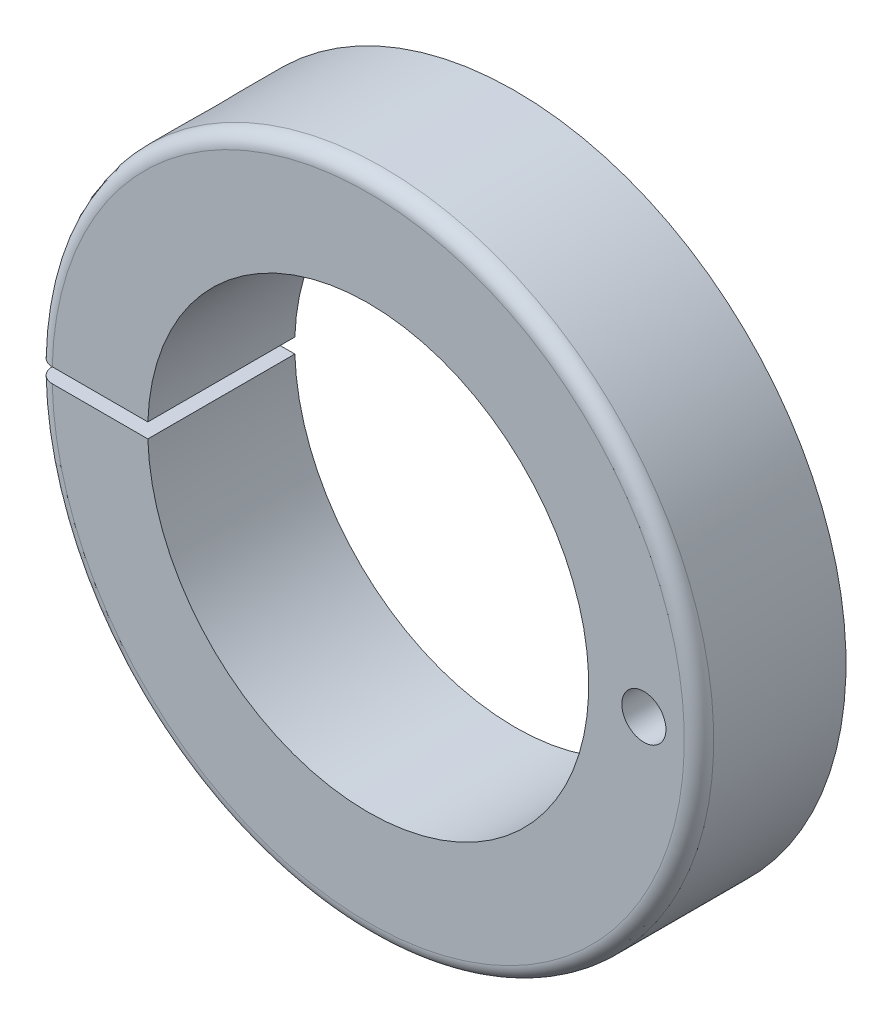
from build123d import *

# Parameters (mm, degrees)
ESQUISSE1_R             = 45
BASE_EXTRUSION_DEPTH    = 20
ESQUISSE2_R             = 30
ENL_V_MAT_EXTRU_1_DEPTH = 20
ESQUISSE3_W             = 30
ESQUISSE3_H             = 2
ENL_V_MAT_EXTRU_2_DEPTH = 20
ESQUISSE4_R             = 3
ENL_V_MAT_EXTRU_3_DEPTH = 103.591422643
ESQUISSE5_R             = 7
ENL_V_MAT_EXTRU_4_DEPTH = 40
CONG_1_R                = 2
ESQUISSE6_R             = 3
ENL_V_MAT_EXTRU_5_DEPTH = 20


with BuildPart() as part:
    # Esquisse1 → Base-Extrusion (new body)
    with BuildSketch(Plane.XY):
        Circle(ESQUISSE1_R)
    extrude(amount=BASE_EXTRUSION_DEPTH)

    # Esquisse2 → Enl_v. mat.-Extru.1 (cut)
    with BuildSketch(Plane.XY.offset(20)):
        Circle(ESQUISSE2_R)
    extrude(amount=-ENL_V_MAT_EXTRU_1_DEPTH, mode=Mode.SUBTRACT)

    # Esquisse3 → Enl_v. mat.-Extru.2 (cut)
    with BuildSketch(Plane.XY.offset(20)):
        with Locations((-35, 0)):
            Rectangle(ESQUISSE3_W, ESQUISSE3_H)
    extrude(amount=-ENL_V_MAT_EXTRU_2_DEPTH, mode=Mode.SUBTRACT)

    # Esquisse4 → Enl_v. mat.-Extru.3 (cut, through all)
    with BuildSketch(Plane(origin=(0, 45, 0), x_dir=(-1, 0, 0), z_dir=(0, 1, 0))):
        with Locations(Location((37.5, 10, 0), (0, 0, 90))):
            Circle(ESQUISSE4_R)
    extrude(amount=-ENL_V_MAT_EXTRU_3_DEPTH, mode=Mode.SUBTRACT)

    # Esquisse5 → Enl_v. mat.-Extru.4 (cut)
    with BuildSketch(Plane(origin=(0, 45, 0), x_dir=(-1, 0, 0), z_dir=(0, 1, 0))):
        with Locations(Location((37.5, 10, 0), (0, 0, 90))):
            Circle(ESQUISSE5_R)
    extrude(amount=-ENL_V_MAT_EXTRU_4_DEPTH, mode=Mode.SUBTRACT)

    # Cong_1
    cong_1_edges = [part.edges().sort_by_distance(p)[0] for p in [
        (0.500030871, 44.997221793, 20),
        (0.500030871, -44.997221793, 20),
    ]]
    fillet(cong_1_edges, radius=CONG_1_R)

    # Esquisse6 → Enl_v. mat.-Extru.5 (cut)
    with BuildSketch(Plane.XY.offset(20)):
        with Locations((37.5, 0)):
            Circle(ESQUISSE6_R)
    extrude(amount=-ENL_V_MAT_EXTRU_5_DEPTH, mode=Mode.SUBTRACT)


solid = part.part
